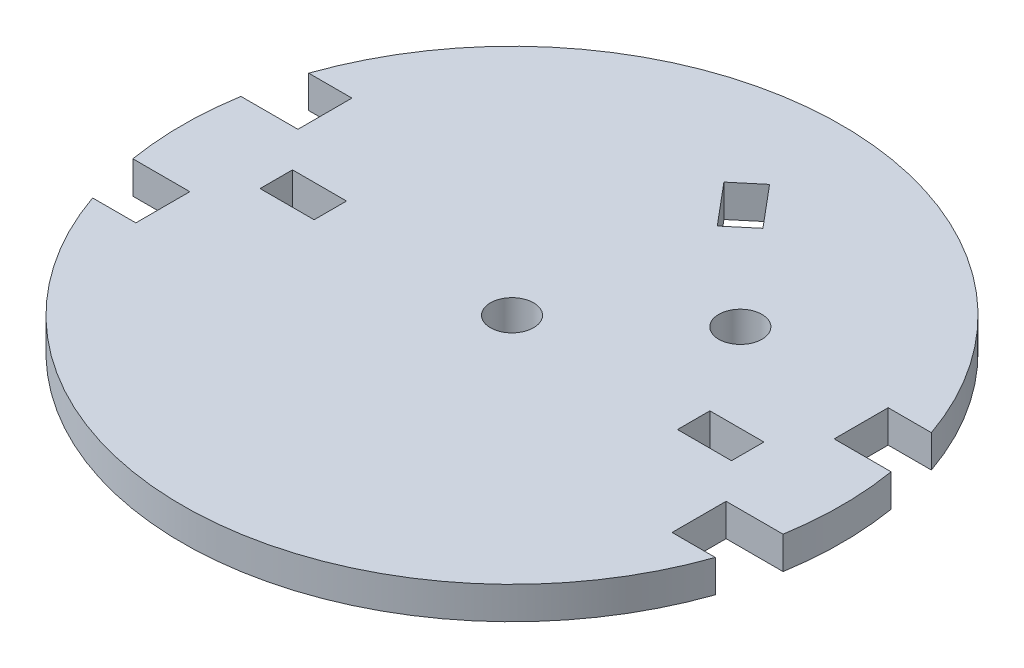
ISO-10303-21;
HEADER;
FILE_DESCRIPTION(('STEP AP214'),'2;1');
FILE_NAME('part.step','',(''),(''),'','','');
FILE_SCHEMA(('AUTOMOTIVE_DESIGN { 1 0 10303 214 1 1 1 1 }'));
ENDSEC;
DATA;
#1=APPLICATION_CONTEXT('core data for automotive mechanical design processes');
#2=APPLICATION_PROTOCOL_DEFINITION('international standard','automotive_design',2000,#1);
#3=PRODUCT_CONTEXT('',#1,'mechanical');
#4=PRODUCT('Part','Part','',(#3));
#5=PRODUCT_RELATED_PRODUCT_CATEGORY('part','',(#4));
#6=PRODUCT_DEFINITION_FORMATION('','',#4);
#7=PRODUCT_DEFINITION_CONTEXT('part definition',#1,'design');
#8=PRODUCT_DEFINITION('design','',#6,#7);
#9=PRODUCT_DEFINITION_SHAPE('','',#8);
#10=(LENGTH_UNIT() NAMED_UNIT(*) SI_UNIT(.MILLI.,.METRE.));
#11=(NAMED_UNIT(*) PLANE_ANGLE_UNIT() SI_UNIT($,.RADIAN.));
#12=(NAMED_UNIT(*) SI_UNIT($,.STERADIAN.) SOLID_ANGLE_UNIT());
#13=UNCERTAINTY_MEASURE_WITH_UNIT(LENGTH_MEASURE(1.E-05),#10,'distance_accuracy_value','');
#14=(GEOMETRIC_REPRESENTATION_CONTEXT(3) GLOBAL_UNCERTAINTY_ASSIGNED_CONTEXT((#13)) GLOBAL_UNIT_ASSIGNED_CONTEXT((#10,
#11,#12)) REPRESENTATION_CONTEXT('',''));
#15=CARTESIAN_POINT('',(0.,0.,0.));
#16=DIRECTION('',(0.,0.,1.));
#17=DIRECTION('',(1.,0.,0.));
#18=AXIS2_PLACEMENT_3D('',#15,#16,#17);
#19=CARTESIAN_POINT('',(0.,3.,0.));
#20=DIRECTION('',(0.,1.,0.));
#21=DIRECTION('',(0.,0.,1.));
#22=AXIS2_PLACEMENT_3D('',#19,#20,#21);
#23=PLANE('',#22);
#24=DIRECTION('',(0.,0.,1.));
#25=VECTOR('',#24,1.);
#26=CARTESIAN_POINT('',(24.8140590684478,3.,0.));
#27=LINE('',#26,#25);
#28=CARTESIAN_POINT('',(24.8140590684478,3.,5.));
#29=VERTEX_POINT('',#28);
#30=CARTESIAN_POINT('',(24.8140590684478,3.,10.));
#31=VERTEX_POINT('',#30);
#32=EDGE_CURVE('E283',#29,#31,#27,.T.);
#33=ORIENTED_EDGE('',*,*,#32,.F.);
#34=DIRECTION('',(1.,0.,0.));
#35=VECTOR('',#34,1.);
#36=CARTESIAN_POINT('',(0.,3.,5.));
#37=LINE('',#36,#35);
#38=CARTESIAN_POINT('',(30.0873727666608,3.,5.));
#39=VERTEX_POINT('',#38);
#40=EDGE_CURVE('E294',#29,#39,#37,.T.);
#41=ORIENTED_EDGE('',*,*,#40,.T.);
#42=CARTESIAN_POINT('',(0.,3.,0.));
#43=DIRECTION('',(0.,1.,0.));
#44=DIRECTION('',(0.,0.,1.));
#45=AXIS2_PLACEMENT_3D('',#42,#43,#44);
#46=CIRCLE('',#45,30.5);
#47=CARTESIAN_POINT('',(30.0873727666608,3.,-5.));
#48=VERTEX_POINT('',#47);
#49=EDGE_CURVE('E368',#39,#48,#46,.T.);
#50=ORIENTED_EDGE('',*,*,#49,.T.);
#51=DIRECTION('',(1.,0.,0.));
#52=VECTOR('',#51,1.);
#53=CARTESIAN_POINT('',(0.,3.,-5.00000000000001));
#54=LINE('',#53,#52);
#55=CARTESIAN_POINT('',(24.8140590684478,3.,-5.));
#56=VERTEX_POINT('',#55);
#57=EDGE_CURVE('E312',#56,#48,#54,.T.);
#58=ORIENTED_EDGE('',*,*,#57,.F.);
#59=DIRECTION('',(0.,0.,-1.));
#60=VECTOR('',#59,1.);
#61=CARTESIAN_POINT('',(24.8140590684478,3.,0.));
#62=LINE('',#61,#60);
#63=CARTESIAN_POINT('',(24.8140590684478,3.,-10.));
#64=VERTEX_POINT('',#63);
#65=EDGE_CURVE('E309',#56,#64,#62,.T.);
#66=ORIENTED_EDGE('',*,*,#65,.T.);
#67=DIRECTION('',(1.,0.,0.));
#68=VECTOR('',#67,1.);
#69=CARTESIAN_POINT('',(0.,3.,-10.));
#70=LINE('',#69,#68);
#71=CARTESIAN_POINT('',(28.8140590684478,3.,-10.));
#72=VERTEX_POINT('',#71);
#73=EDGE_CURVE('E306',#64,#72,#70,.T.);
#74=ORIENTED_EDGE('',*,*,#73,.T.);
#75=CARTESIAN_POINT('',(-28.8140590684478,3.,-10.));
#76=VERTEX_POINT('',#75);
#77=EDGE_CURVE('E815',#72,#76,#46,.T.);
#78=ORIENTED_EDGE('',*,*,#77,.T.);
#79=DIRECTION('',(-1.,0.,0.));
#80=VECTOR('',#79,1.);
#81=CARTESIAN_POINT('',(0.,3.,-10.));
#82=LINE('',#81,#80);
#83=CARTESIAN_POINT('',(-24.8140590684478,3.,-10.));
#84=VERTEX_POINT('',#83);
#85=EDGE_CURVE('E330',#84,#76,#82,.T.);
#86=ORIENTED_EDGE('',*,*,#85,.F.);
#87=DIRECTION('',(0.,0.,-1.));
#88=VECTOR('',#87,1.);
#89=CARTESIAN_POINT('',(-24.8140590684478,3.,0.));
#90=LINE('',#89,#88);
#91=CARTESIAN_POINT('',(-24.8140590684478,3.,-5.));
#92=VERTEX_POINT('',#91);
#93=EDGE_CURVE('E327',#92,#84,#90,.T.);
#94=ORIENTED_EDGE('',*,*,#93,.F.);
#95=DIRECTION('',(-1.,0.,0.));
#96=VECTOR('',#95,1.);
#97=CARTESIAN_POINT('',(0.,3.,-5.));
#98=LINE('',#97,#96);
#99=CARTESIAN_POINT('',(-30.0873727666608,3.,-5.));
#100=VERTEX_POINT('',#99);
#101=EDGE_CURVE('E324',#92,#100,#98,.T.);
#102=ORIENTED_EDGE('',*,*,#101,.T.);
#103=CARTESIAN_POINT('',(-30.0873727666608,3.,5.));
#104=VERTEX_POINT('',#103);
#105=EDGE_CURVE('E369',#100,#104,#46,.T.);
#106=ORIENTED_EDGE('',*,*,#105,.T.);
#107=DIRECTION('',(-1.,0.,0.));
#108=VECTOR('',#107,1.);
#109=CARTESIAN_POINT('',(0.,3.,5.00000000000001));
#110=LINE('',#109,#108);
#111=CARTESIAN_POINT('',(-24.8140590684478,3.,5.));
#112=VERTEX_POINT('',#111);
#113=EDGE_CURVE('E336',#112,#104,#110,.T.);
#114=ORIENTED_EDGE('',*,*,#113,.F.);
#115=DIRECTION('',(0.,0.,1.));
#116=VECTOR('',#115,1.);
#117=CARTESIAN_POINT('',(-24.8140590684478,3.,0.));
#118=LINE('',#117,#116);
#119=CARTESIAN_POINT('',(-24.8140590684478,3.,10.));
#120=VERTEX_POINT('',#119);
#121=EDGE_CURVE('E348',#112,#120,#118,.T.);
#122=ORIENTED_EDGE('',*,*,#121,.T.);
#123=DIRECTION('',(-1.,0.,0.));
#124=VECTOR('',#123,1.);
#125=CARTESIAN_POINT('',(0.,3.,10.));
#126=LINE('',#125,#124);
#127=CARTESIAN_POINT('',(-28.8140590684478,3.,10.));
#128=VERTEX_POINT('',#127);
#129=EDGE_CURVE('E345',#120,#128,#126,.T.);
#130=ORIENTED_EDGE('',*,*,#129,.T.);
#131=CARTESIAN_POINT('',(28.8140590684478,3.,10.));
#132=VERTEX_POINT('',#131);
#133=EDGE_CURVE('E364',#128,#132,#46,.T.);
#134=ORIENTED_EDGE('',*,*,#133,.T.);
#135=DIRECTION('',(1.,0.,0.));
#136=VECTOR('',#135,1.);
#137=CARTESIAN_POINT('',(0.,3.,10.));
#138=LINE('',#137,#136);
#139=EDGE_CURVE('E292',#31,#132,#138,.T.);
#140=ORIENTED_EDGE('',*,*,#139,.F.);
#141=EDGE_LOOP('',(#33,#41,#50,#58,#66,#74,#78,#86,#94,#102,#106,#114,#122,#130,#134,#140));
#142=FACE_BOUND('',#141,.T.);
#143=CARTESIAN_POINT('',(0.,3.,0.));
#144=DIRECTION('',(0.,1.,0.));
#145=DIRECTION('',(0.,0.,1.));
#146=AXIS2_PLACEMENT_3D('',#143,#144,#145);
#147=CIRCLE('',#146,2.);
#148=CARTESIAN_POINT('',(0.,3.,2.));
#149=VERTEX_POINT('',#148);
#150=EDGE_CURVE('E354',#149,#149,#147,.T.);
#151=ORIENTED_EDGE('',*,*,#150,.F.);
#152=EDGE_LOOP('',(#151));
#153=FACE_BOUND('',#152,.T.);
#154=DIRECTION('',(1.,0.,0.));
#155=VECTOR('',#154,1.);
#156=CARTESIAN_POINT('',(-16.8140590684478,3.,1.5));
#157=LINE('',#156,#155);
#158=CARTESIAN_POINT('',(-21.8140590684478,3.,1.5));
#159=VERTEX_POINT('',#158);
#160=CARTESIAN_POINT('',(-16.8140590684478,3.,1.5));
#161=VERTEX_POINT('',#160);
#162=EDGE_CURVE('E263',#159,#161,#157,.T.);
#163=ORIENTED_EDGE('',*,*,#162,.F.);
#164=DIRECTION('',(0.,0.,1.));
#165=VECTOR('',#164,1.);
#166=CARTESIAN_POINT('',(-21.8140590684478,3.,-1.5));
#167=LINE('',#166,#165);
#168=CARTESIAN_POINT('',(-21.8140590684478,3.,-1.5));
#169=VERTEX_POINT('',#168);
#170=EDGE_CURVE('E277',#169,#159,#167,.T.);
#171=ORIENTED_EDGE('',*,*,#170,.F.);
#172=DIRECTION('',(-1.,0.,0.));
#173=VECTOR('',#172,1.);
#174=CARTESIAN_POINT('',(-16.8140590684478,3.,-1.5));
#175=LINE('',#174,#173);
#176=CARTESIAN_POINT('',(-16.8140590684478,3.,-1.5));
#177=VERTEX_POINT('',#176);
#178=EDGE_CURVE('E274',#177,#169,#175,.T.);
#179=ORIENTED_EDGE('',*,*,#178,.F.);
#180=DIRECTION('',(0.,0.,-1.));
#181=VECTOR('',#180,1.);
#182=CARTESIAN_POINT('',(-16.8140590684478,3.,1.5));
#183=LINE('',#182,#181);
#184=EDGE_CURVE('E271',#161,#177,#183,.T.);
#185=ORIENTED_EDGE('',*,*,#184,.F.);
#186=EDGE_LOOP('',(#163,#171,#179,#185));
#187=FACE_BOUND('',#186,.T.);
#188=DIRECTION('',(0.,0.,1.));
#189=VECTOR('',#188,1.);
#190=CARTESIAN_POINT('',(16.8140590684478,3.,1.5));
#191=LINE('',#190,#189);
#192=CARTESIAN_POINT('',(16.8140590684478,3.,-1.5));
#193=VERTEX_POINT('',#192);
#194=CARTESIAN_POINT('',(16.8140590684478,3.,1.5));
#195=VERTEX_POINT('',#194);
#196=EDGE_CURVE('E249',#193,#195,#191,.T.);
#197=ORIENTED_EDGE('',*,*,#196,.F.);
#198=DIRECTION('',(-1.,0.,0.));
#199=VECTOR('',#198,1.);
#200=CARTESIAN_POINT('',(16.8140590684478,3.,-1.5));
#201=LINE('',#200,#199);
#202=CARTESIAN_POINT('',(21.8140590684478,3.,-1.5));
#203=VERTEX_POINT('',#202);
#204=EDGE_CURVE('E257',#203,#193,#201,.T.);
#205=ORIENTED_EDGE('',*,*,#204,.F.);
#206=DIRECTION('',(0.,0.,-1.));
#207=VECTOR('',#206,1.);
#208=CARTESIAN_POINT('',(21.8140590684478,3.,-1.5));
#209=LINE('',#208,#207);
#210=CARTESIAN_POINT('',(21.8140590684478,3.,1.5));
#211=VERTEX_POINT('',#210);
#212=EDGE_CURVE('E254',#211,#203,#209,.T.);
#213=ORIENTED_EDGE('',*,*,#212,.F.);
#214=DIRECTION('',(1.,0.,0.));
#215=VECTOR('',#214,1.);
#216=CARTESIAN_POINT('',(16.8140590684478,3.,1.5));
#217=LINE('',#216,#215);
#218=EDGE_CURVE('E251',#195,#211,#217,.T.);
#219=ORIENTED_EDGE('',*,*,#218,.F.);
#220=EDGE_LOOP('',(#197,#205,#213,#219));
#221=FACE_BOUND('',#220,.T.);
#222=CARTESIAN_POINT('',(11.4906666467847,3.,-9.64181414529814));
#223=DIRECTION('',(0.,1.,0.));
#224=DIRECTION('',(0.,0.,1.));
#225=AXIS2_PLACEMENT_3D('',#222,#223,#224);
#226=CIRCLE('',#225,2.);
#227=CARTESIAN_POINT('',(11.4906666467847,3.,-7.64181414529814));
#228=VERTEX_POINT('',#227);
#229=EDGE_CURVE('E243',#228,#228,#226,.T.);
#230=ORIENTED_EDGE('',*,*,#229,.F.);
#231=EDGE_LOOP('',(#230));
#232=FACE_BOUND('',#231,.T.);
#233=DIRECTION('',(0.64278760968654,0.,0.766044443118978));
#234=VECTOR('',#233,1.);
#235=CARTESIAN_POINT('',(11.8736888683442,3.,-9.96320795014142));
#236=LINE('',#235,#234);
#237=CARTESIAN_POINT('',(1.42839021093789,3.,-22.4114301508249));
#238=VERTEX_POINT('',#237);
#239=CARTESIAN_POINT('',(4.64232825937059,3.,-18.58120793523));
#240=VERTEX_POINT('',#239);
#241=EDGE_CURVE('E231',#238,#240,#236,.T.);
#242=ORIENTED_EDGE('',*,*,#241,.T.);
#243=DIRECTION('',(-0.766044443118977,0.,0.64278760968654));
#244=VECTOR('',#243,1.);
#245=CARTESIAN_POINT('',(-7.23136060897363,3.,-8.61799998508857));
#246=LINE('',#245,#244);
#247=CARTESIAN_POINT('',(2.34419493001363,3.,-16.6528451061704));
#248=VERTEX_POINT('',#247);
#249=EDGE_CURVE('E50',#240,#248,#246,.T.);
#250=ORIENTED_EDGE('',*,*,#249,.T.);
#251=DIRECTION('',(0.642787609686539,0.,0.766044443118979));
#252=VECTOR('',#251,1.);
#253=CARTESIAN_POINT('',(9.57555553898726,3.,-8.03484512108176));
#254=LINE('',#253,#252);
#255=CARTESIAN_POINT('',(-0.86974311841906,3.,-20.4830673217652));
#256=VERTEX_POINT('',#255);
#257=EDGE_CURVE('E236',#256,#248,#254,.T.);
#258=ORIENTED_EDGE('',*,*,#257,.F.);
#259=DIRECTION('',(-0.766044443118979,0.,0.642787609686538));
#260=VECTOR('',#259,1.);
#261=CARTESIAN_POINT('',(-10.4452986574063,3.,-12.4482222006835));
#262=LINE('',#261,#260);
#263=EDGE_CURVE('E222',#238,#256,#262,.T.);
#264=ORIENTED_EDGE('',*,*,#263,.F.);
#265=EDGE_LOOP('',(#242,#250,#258,#264));
#266=FACE_BOUND('',#265,.T.);
#267=ADVANCED_FACE('F35',(#142,#153,#187,#221,#232,#266),#23,.T.);
#268=CARTESIAN_POINT('',(0.,0.,0.));
#269=DIRECTION('',(0.,1.,0.));
#270=DIRECTION('',(0.,0.,1.));
#271=AXIS2_PLACEMENT_3D('',#268,#269,#270);
#272=PLANE('',#271);
#273=DIRECTION('',(1.,0.,0.));
#274=VECTOR('',#273,1.);
#275=CARTESIAN_POINT('',(0.,0.,5.));
#276=LINE('',#275,#274);
#277=CARTESIAN_POINT('',(24.8140590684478,0.,5.));
#278=VERTEX_POINT('',#277);
#279=CARTESIAN_POINT('',(30.0873727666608,0.,5.));
#280=VERTEX_POINT('',#279);
#281=EDGE_CURVE('E304',#278,#280,#276,.T.);
#282=ORIENTED_EDGE('',*,*,#281,.F.);
#283=DIRECTION('',(0.,0.,1.));
#284=VECTOR('',#283,1.);
#285=CARTESIAN_POINT('',(24.8140590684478,0.,0.));
#286=LINE('',#285,#284);
#287=CARTESIAN_POINT('',(24.8140590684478,0.,10.));
#288=VERTEX_POINT('',#287);
#289=EDGE_CURVE('E404',#278,#288,#286,.T.);
#290=ORIENTED_EDGE('',*,*,#289,.T.);
#291=DIRECTION('',(1.,0.,0.));
#292=VECTOR('',#291,1.);
#293=CARTESIAN_POINT('',(0.,0.,10.));
#294=LINE('',#293,#292);
#295=CARTESIAN_POINT('',(28.8140590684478,0.,10.));
#296=VERTEX_POINT('',#295);
#297=EDGE_CURVE('E300',#288,#296,#294,.T.);
#298=ORIENTED_EDGE('',*,*,#297,.T.);
#299=CARTESIAN_POINT('',(0.,0.,0.));
#300=DIRECTION('',(0.,1.,0.));
#301=DIRECTION('',(0.,0.,1.));
#302=AXIS2_PLACEMENT_3D('',#299,#300,#301);
#303=CIRCLE('',#302,30.5);
#304=CARTESIAN_POINT('',(-28.8140590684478,0.,10.));
#305=VERTEX_POINT('',#304);
#306=EDGE_CURVE('E370',#305,#296,#303,.T.);
#307=ORIENTED_EDGE('',*,*,#306,.F.);
#308=DIRECTION('',(-1.,0.,0.));
#309=VECTOR('',#308,1.);
#310=CARTESIAN_POINT('',(0.,0.,10.));
#311=LINE('',#310,#309);
#312=CARTESIAN_POINT('',(-24.8140590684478,0.,10.));
#313=VERTEX_POINT('',#312);
#314=EDGE_CURVE('E367',#313,#305,#311,.T.);
#315=ORIENTED_EDGE('',*,*,#314,.F.);
#316=DIRECTION('',(0.,0.,1.));
#317=VECTOR('',#316,1.);
#318=CARTESIAN_POINT('',(-24.8140590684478,0.,0.));
#319=LINE('',#318,#317);
#320=CARTESIAN_POINT('',(-24.8140590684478,0.,5.));
#321=VERTEX_POINT('',#320);
#322=EDGE_CURVE('E378',#321,#313,#319,.T.);
#323=ORIENTED_EDGE('',*,*,#322,.F.);
#324=DIRECTION('',(-1.,0.,0.));
#325=VECTOR('',#324,1.);
#326=CARTESIAN_POINT('',(0.,0.,5.00000000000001));
#327=LINE('',#326,#325);
#328=CARTESIAN_POINT('',(-30.0873727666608,0.,5.));
#329=VERTEX_POINT('',#328);
#330=EDGE_CURVE('E381',#321,#329,#327,.T.);
#331=ORIENTED_EDGE('',*,*,#330,.T.);
#332=CARTESIAN_POINT('',(-30.0873727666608,0.,-5.));
#333=VERTEX_POINT('',#332);
#334=EDGE_CURVE('E374',#333,#329,#303,.T.);
#335=ORIENTED_EDGE('',*,*,#334,.F.);
#336=DIRECTION('',(-1.,0.,0.));
#337=VECTOR('',#336,1.);
#338=CARTESIAN_POINT('',(0.,0.,-5.));
#339=LINE('',#338,#337);
#340=CARTESIAN_POINT('',(-24.8140590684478,0.,-5.));
#341=VERTEX_POINT('',#340);
#342=EDGE_CURVE('E390',#341,#333,#339,.T.);
#343=ORIENTED_EDGE('',*,*,#342,.F.);
#344=DIRECTION('',(0.,0.,-1.));
#345=VECTOR('',#344,1.);
#346=CARTESIAN_POINT('',(-24.8140590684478,0.,0.));
#347=LINE('',#346,#345);
#348=CARTESIAN_POINT('',(-24.8140590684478,0.,-10.));
#349=VERTEX_POINT('',#348);
#350=EDGE_CURVE('E384',#341,#349,#347,.T.);
#351=ORIENTED_EDGE('',*,*,#350,.T.);
#352=DIRECTION('',(-1.,0.,0.));
#353=VECTOR('',#352,1.);
#354=CARTESIAN_POINT('',(0.,0.,-10.));
#355=LINE('',#354,#353);
#356=CARTESIAN_POINT('',(-28.8140590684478,0.,-10.));
#357=VERTEX_POINT('',#356);
#358=EDGE_CURVE('E387',#349,#357,#355,.T.);
#359=ORIENTED_EDGE('',*,*,#358,.T.);
#360=CARTESIAN_POINT('',(28.8140590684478,0.,-10.));
#361=VERTEX_POINT('',#360);
#362=EDGE_CURVE('E799',#361,#357,#303,.T.);
#363=ORIENTED_EDGE('',*,*,#362,.F.);
#364=DIRECTION('',(1.,0.,0.));
#365=VECTOR('',#364,1.);
#366=CARTESIAN_POINT('',(0.,0.,-10.));
#367=LINE('',#366,#365);
#368=CARTESIAN_POINT('',(24.8140590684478,0.,-10.));
#369=VERTEX_POINT('',#368);
#370=EDGE_CURVE('E322',#369,#361,#367,.T.);
#371=ORIENTED_EDGE('',*,*,#370,.F.);
#372=DIRECTION('',(0.,0.,-1.));
#373=VECTOR('',#372,1.);
#374=CARTESIAN_POINT('',(24.8140590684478,0.,0.));
#375=LINE('',#374,#373);
#376=CARTESIAN_POINT('',(24.8140590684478,0.,-5.));
#377=VERTEX_POINT('',#376);
#378=EDGE_CURVE('E397',#377,#369,#375,.T.);
#379=ORIENTED_EDGE('',*,*,#378,.F.);
#380=DIRECTION('',(1.,0.,0.));
#381=VECTOR('',#380,1.);
#382=CARTESIAN_POINT('',(0.,0.,-5.00000000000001));
#383=LINE('',#382,#381);
#384=CARTESIAN_POINT('',(30.0873727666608,0.,-5.));
#385=VERTEX_POINT('',#384);
#386=EDGE_CURVE('E318',#377,#385,#383,.T.);
#387=ORIENTED_EDGE('',*,*,#386,.T.);
#388=EDGE_CURVE('E373',#280,#385,#303,.T.);
#389=ORIENTED_EDGE('',*,*,#388,.F.);
#390=EDGE_LOOP('',(#282,#290,#298,#307,#315,#323,#331,#335,#343,#351,#359,#363,#371,#379,#387,#389));
#391=FACE_BOUND('',#390,.T.);
#392=CARTESIAN_POINT('',(0.,0.,0.));
#393=DIRECTION('',(0.,1.,0.));
#394=DIRECTION('',(0.,0.,1.));
#395=AXIS2_PLACEMENT_3D('',#392,#393,#394);
#396=CIRCLE('',#395,2.);
#397=CARTESIAN_POINT('',(0.,0.,2.));
#398=VERTEX_POINT('',#397);
#399=EDGE_CURVE('E363',#398,#398,#396,.T.);
#400=ORIENTED_EDGE('',*,*,#399,.T.);
#401=EDGE_LOOP('',(#400));
#402=FACE_BOUND('',#401,.T.);
#403=DIRECTION('',(0.,0.,1.));
#404=VECTOR('',#403,1.);
#405=CARTESIAN_POINT('',(-21.8140590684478,0.,0.));
#406=LINE('',#405,#404);
#407=CARTESIAN_POINT('',(-21.8140590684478,0.,-1.5));
#408=VERTEX_POINT('',#407);
#409=CARTESIAN_POINT('',(-21.8140590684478,0.,1.5));
#410=VERTEX_POINT('',#409);
#411=EDGE_CURVE('E413',#408,#410,#406,.T.);
#412=ORIENTED_EDGE('',*,*,#411,.T.);
#413=DIRECTION('',(1.,0.,0.));
#414=VECTOR('',#413,1.);
#415=CARTESIAN_POINT('',(0.,0.,1.5));
#416=LINE('',#415,#414);
#417=CARTESIAN_POINT('',(-16.8140590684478,0.,1.5));
#418=VERTEX_POINT('',#417);
#419=EDGE_CURVE('E416',#410,#418,#416,.T.);
#420=ORIENTED_EDGE('',*,*,#419,.T.);
#421=DIRECTION('',(0.,0.,-1.));
#422=VECTOR('',#421,1.);
#423=CARTESIAN_POINT('',(-16.8140590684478,0.,0.));
#424=LINE('',#423,#422);
#425=CARTESIAN_POINT('',(-16.8140590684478,0.,-1.5));
#426=VERTEX_POINT('',#425);
#427=EDGE_CURVE('E407',#418,#426,#424,.T.);
#428=ORIENTED_EDGE('',*,*,#427,.T.);
#429=DIRECTION('',(-1.,0.,0.));
#430=VECTOR('',#429,1.);
#431=CARTESIAN_POINT('',(0.,0.,-1.5));
#432=LINE('',#431,#430);
#433=EDGE_CURVE('E410',#426,#408,#432,.T.);
#434=ORIENTED_EDGE('',*,*,#433,.T.);
#435=EDGE_LOOP('',(#412,#420,#428,#434));
#436=FACE_BOUND('',#435,.T.);
#437=DIRECTION('',(-1.,0.,0.));
#438=VECTOR('',#437,1.);
#439=CARTESIAN_POINT('',(0.,0.,-1.5));
#440=LINE('',#439,#438);
#441=CARTESIAN_POINT('',(21.8140590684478,0.,-1.5));
#442=VERTEX_POINT('',#441);
#443=CARTESIAN_POINT('',(16.8140590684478,0.,-1.5));
#444=VERTEX_POINT('',#443);
#445=EDGE_CURVE('E425',#442,#444,#440,.T.);
#446=ORIENTED_EDGE('',*,*,#445,.T.);
#447=DIRECTION('',(0.,0.,1.));
#448=VECTOR('',#447,1.);
#449=CARTESIAN_POINT('',(16.8140590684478,0.,0.));
#450=LINE('',#449,#448);
#451=CARTESIAN_POINT('',(16.8140590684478,0.,1.5));
#452=VERTEX_POINT('',#451);
#453=EDGE_CURVE('E428',#444,#452,#450,.T.);
#454=ORIENTED_EDGE('',*,*,#453,.T.);
#455=DIRECTION('',(1.,0.,0.));
#456=VECTOR('',#455,1.);
#457=CARTESIAN_POINT('',(0.,0.,1.5));
#458=LINE('',#457,#456);
#459=CARTESIAN_POINT('',(21.8140590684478,0.,1.5));
#460=VERTEX_POINT('',#459);
#461=EDGE_CURVE('E419',#452,#460,#458,.T.);
#462=ORIENTED_EDGE('',*,*,#461,.T.);
#463=DIRECTION('',(0.,0.,-1.));
#464=VECTOR('',#463,1.);
#465=CARTESIAN_POINT('',(21.8140590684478,0.,0.));
#466=LINE('',#465,#464);
#467=EDGE_CURVE('E422',#460,#442,#466,.T.);
#468=ORIENTED_EDGE('',*,*,#467,.T.);
#469=EDGE_LOOP('',(#446,#454,#462,#468));
#470=FACE_BOUND('',#469,.T.);
#471=CARTESIAN_POINT('',(11.4906666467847,0.,-9.64181414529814));
#472=DIRECTION('',(0.,1.,0.));
#473=DIRECTION('',(0.,0.,1.));
#474=AXIS2_PLACEMENT_3D('',#471,#472,#473);
#475=CIRCLE('',#474,2.);
#476=CARTESIAN_POINT('',(11.4906666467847,0.,-7.64181414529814));
#477=VERTEX_POINT('',#476);
#478=EDGE_CURVE('E248',#477,#477,#475,.T.);
#479=ORIENTED_EDGE('',*,*,#478,.T.);
#480=EDGE_LOOP('',(#479));
#481=FACE_BOUND('',#480,.T.);
#482=DIRECTION('',(-0.766044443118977,0.,0.64278760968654));
#483=VECTOR('',#482,1.);
#484=CARTESIAN_POINT('',(-7.23136060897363,0.,-8.61799998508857));
#485=LINE('',#484,#483);
#486=CARTESIAN_POINT('',(4.64232825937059,0.,-18.58120793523));
#487=VERTEX_POINT('',#486);
#488=CARTESIAN_POINT('',(2.34419493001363,0.,-16.6528451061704));
#489=VERTEX_POINT('',#488);
#490=EDGE_CURVE('E11',#487,#489,#485,.T.);
#491=ORIENTED_EDGE('',*,*,#490,.F.);
#492=DIRECTION('',(0.64278760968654,0.,0.766044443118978));
#493=VECTOR('',#492,1.);
#494=CARTESIAN_POINT('',(11.8736888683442,0.,-9.96320795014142));
#495=LINE('',#494,#493);
#496=CARTESIAN_POINT('',(1.4283902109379,0.,-22.4114301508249));
#497=VERTEX_POINT('',#496);
#498=EDGE_CURVE('E431',#497,#487,#495,.T.);
#499=ORIENTED_EDGE('',*,*,#498,.F.);
#500=DIRECTION('',(-0.766044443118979,0.,0.642787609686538));
#501=VECTOR('',#500,1.);
#502=CARTESIAN_POINT('',(-10.4452986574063,0.,-12.4482222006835));
#503=LINE('',#502,#501);
#504=CARTESIAN_POINT('',(-0.86974311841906,0.,-20.4830673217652));
#505=VERTEX_POINT('',#504);
#506=EDGE_CURVE('E225',#497,#505,#503,.T.);
#507=ORIENTED_EDGE('',*,*,#506,.T.);
#508=DIRECTION('',(0.642787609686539,0.,0.766044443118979));
#509=VECTOR('',#508,1.);
#510=CARTESIAN_POINT('',(9.57555553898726,0.,-8.03484512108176));
#511=LINE('',#510,#509);
#512=EDGE_CURVE('E43',#505,#489,#511,.T.);
#513=ORIENTED_EDGE('',*,*,#512,.T.);
#514=EDGE_LOOP('',(#491,#499,#507,#513));
#515=FACE_BOUND('',#514,.T.);
#516=ADVANCED_FACE('F438',(#391,#402,#436,#470,#481,#515),#272,.F.);
#517=CARTESIAN_POINT('',(0.,3.,0.));
#518=DIRECTION('',(0.,-1.,0.));
#519=DIRECTION('',(0.,0.,-1.));
#520=AXIS2_PLACEMENT_3D('',#517,#518,#519);
#521=CYLINDRICAL_SURFACE('',#520,30.5);
#522=DIRECTION('',(0.,-1.,0.));
#523=VECTOR('',#522,1.);
#524=CARTESIAN_POINT('',(30.0873727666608,3.,5.));
#525=LINE('',#524,#523);
#526=EDGE_CURVE('E402',#280,#39,#525,.F.);
#527=ORIENTED_EDGE('',*,*,#526,.F.);
#528=ORIENTED_EDGE('',*,*,#388,.T.);
#529=DIRECTION('',(0.,-1.,0.));
#530=VECTOR('',#529,1.);
#531=CARTESIAN_POINT('',(30.0873727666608,3.,-5.));
#532=LINE('',#531,#530);
#533=EDGE_CURVE('E392',#385,#48,#532,.F.);
#534=ORIENTED_EDGE('',*,*,#533,.T.);
#535=ORIENTED_EDGE('',*,*,#49,.F.);
#536=EDGE_LOOP('',(#527,#528,#534,#535));
#537=FACE_BOUND('',#536,.T.);
#538=ADVANCED_FACE('F461',(#537),#521,.T.);
#539=DIRECTION('',(0.,-1.,0.));
#540=VECTOR('',#539,1.);
#541=CARTESIAN_POINT('',(28.8140590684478,3.,-10.));
#542=LINE('',#541,#540);
#543=EDGE_CURVE('E395',#361,#72,#542,.F.);
#544=ORIENTED_EDGE('',*,*,#543,.F.);
#545=ORIENTED_EDGE('',*,*,#362,.T.);
#546=DIRECTION('',(0.,1.,0.));
#547=VECTOR('',#546,1.);
#548=CARTESIAN_POINT('',(-28.8140590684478,-1.,-10.));
#549=LINE('',#548,#547);
#550=EDGE_CURVE('E337',#357,#76,#549,.T.);
#551=ORIENTED_EDGE('',*,*,#550,.T.);
#552=ORIENTED_EDGE('',*,*,#77,.F.);
#553=EDGE_LOOP('',(#544,#545,#551,#552));
#554=FACE_BOUND('',#553,.T.);
#555=ADVANCED_FACE('F625',(#554),#521,.T.);
#556=DIRECTION('',(0.,1.,0.));
#557=VECTOR('',#556,1.);
#558=CARTESIAN_POINT('',(-30.0873727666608,-1.,-5.));
#559=LINE('',#558,#557);
#560=EDGE_CURVE('E334',#333,#100,#559,.T.);
#561=ORIENTED_EDGE('',*,*,#560,.F.);
#562=ORIENTED_EDGE('',*,*,#334,.T.);
#563=DIRECTION('',(0.,1.,0.));
#564=VECTOR('',#563,1.);
#565=CARTESIAN_POINT('',(-30.0873727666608,-1.,5.));
#566=LINE('',#565,#564);
#567=EDGE_CURVE('E351',#329,#104,#566,.T.);
#568=ORIENTED_EDGE('',*,*,#567,.T.);
#569=ORIENTED_EDGE('',*,*,#105,.F.);
#570=EDGE_LOOP('',(#561,#562,#568,#569));
#571=FACE_BOUND('',#570,.T.);
#572=ADVANCED_FACE('F633',(#571),#521,.T.);
#573=ORIENTED_EDGE('',*,*,#306,.T.);
#574=DIRECTION('',(0.,-1.,0.));
#575=VECTOR('',#574,1.);
#576=CARTESIAN_POINT('',(28.8140590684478,3.,10.));
#577=LINE('',#576,#575);
#578=EDGE_CURVE('E399',#296,#132,#577,.F.);
#579=ORIENTED_EDGE('',*,*,#578,.T.);
#580=ORIENTED_EDGE('',*,*,#133,.F.);
#581=DIRECTION('',(0.,1.,0.));
#582=VECTOR('',#581,1.);
#583=CARTESIAN_POINT('',(-28.8140590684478,-1.,10.));
#584=LINE('',#583,#582);
#585=EDGE_CURVE('E357',#305,#128,#584,.T.);
#586=ORIENTED_EDGE('',*,*,#585,.F.);
#587=EDGE_LOOP('',(#573,#579,#580,#586));
#588=FACE_BOUND('',#587,.T.);
#589=ADVANCED_FACE('F37',(#588),#521,.T.);
#590=CARTESIAN_POINT('',(0.,-1.,0.));
#591=DIRECTION('',(0.,1.,0.));
#592=DIRECTION('',(0.,0.,1.));
#593=AXIS2_PLACEMENT_3D('',#590,#591,#592);
#594=CYLINDRICAL_SURFACE('',#593,2.);
#595=ORIENTED_EDGE('',*,*,#150,.T.);
#596=EDGE_LOOP('',(#595));
#597=FACE_BOUND('',#596,.T.);
#598=ORIENTED_EDGE('',*,*,#399,.F.);
#599=EDGE_LOOP('',(#598));
#600=FACE_BOUND('',#599,.T.);
#601=ADVANCED_FACE('F466',(#597,#600),#594,.F.);
#602=CARTESIAN_POINT('',(0.,-1.,5.00000000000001));
#603=DIRECTION('',(0.,0.,-1.));
#604=DIRECTION('',(-1.,0.,0.));
#605=AXIS2_PLACEMENT_3D('',#602,#603,#604);
#606=PLANE('',#605);
#607=DIRECTION('',(0.,1.,0.));
#608=VECTOR('',#607,1.);
#609=CARTESIAN_POINT('',(-24.8140590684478,-1.,5.));
#610=LINE('',#609,#608);
#611=EDGE_CURVE('E352',#321,#112,#610,.T.);
#612=ORIENTED_EDGE('',*,*,#611,.T.);
#613=ORIENTED_EDGE('',*,*,#113,.T.);
#614=ORIENTED_EDGE('',*,*,#567,.F.);
#615=ORIENTED_EDGE('',*,*,#330,.F.);
#616=EDGE_LOOP('',(#612,#613,#614,#615));
#617=FACE_BOUND('',#616,.T.);
#618=ADVANCED_FACE('F469',(#617),#606,.F.);
#619=CARTESIAN_POINT('',(-24.8140590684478,-1.,0.));
#620=DIRECTION('',(-1.,0.,0.));
#621=DIRECTION('',(0.,0.,1.));
#622=AXIS2_PLACEMENT_3D('',#619,#620,#621);
#623=PLANE('',#622);
#624=ORIENTED_EDGE('',*,*,#322,.T.);
#625=DIRECTION('',(0.,1.,0.));
#626=VECTOR('',#625,1.);
#627=CARTESIAN_POINT('',(-24.8140590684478,-1.,10.));
#628=LINE('',#627,#626);
#629=EDGE_CURVE('E355',#313,#120,#628,.T.);
#630=ORIENTED_EDGE('',*,*,#629,.T.);
#631=ORIENTED_EDGE('',*,*,#121,.F.);
#632=ORIENTED_EDGE('',*,*,#611,.F.);
#633=EDGE_LOOP('',(#624,#630,#631,#632));
#634=FACE_BOUND('',#633,.T.);
#635=ADVANCED_FACE('F473',(#634),#623,.T.);
#636=CARTESIAN_POINT('',(0.,-1.,10.));
#637=DIRECTION('',(0.,0.,-1.));
#638=DIRECTION('',(-1.,0.,0.));
#639=AXIS2_PLACEMENT_3D('',#636,#637,#638);
#640=PLANE('',#639);
#641=ORIENTED_EDGE('',*,*,#314,.T.);
#642=ORIENTED_EDGE('',*,*,#585,.T.);
#643=ORIENTED_EDGE('',*,*,#129,.F.);
#644=ORIENTED_EDGE('',*,*,#629,.F.);
#645=EDGE_LOOP('',(#641,#642,#643,#644));
#646=FACE_BOUND('',#645,.T.);
#647=ADVANCED_FACE('F475',(#646),#640,.T.);
#648=CARTESIAN_POINT('',(0.,-1.,-5.));
#649=DIRECTION('',(0.,0.,-1.));
#650=DIRECTION('',(-1.,0.,0.));
#651=AXIS2_PLACEMENT_3D('',#648,#649,#650);
#652=PLANE('',#651);
#653=ORIENTED_EDGE('',*,*,#342,.T.);
#654=ORIENTED_EDGE('',*,*,#560,.T.);
#655=ORIENTED_EDGE('',*,*,#101,.F.);
#656=DIRECTION('',(0.,1.,0.));
#657=VECTOR('',#656,1.);
#658=CARTESIAN_POINT('',(-24.8140590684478,-1.,-5.));
#659=LINE('',#658,#657);
#660=EDGE_CURVE('E333',#341,#92,#659,.T.);
#661=ORIENTED_EDGE('',*,*,#660,.F.);
#662=EDGE_LOOP('',(#653,#654,#655,#661));
#663=FACE_BOUND('',#662,.T.);
#664=ADVANCED_FACE('F478',(#663),#652,.T.);
#665=CARTESIAN_POINT('',(0.,-1.,-10.));
#666=DIRECTION('',(0.,0.,-1.));
#667=DIRECTION('',(-1.,0.,0.));
#668=AXIS2_PLACEMENT_3D('',#665,#666,#667);
#669=PLANE('',#668);
#670=DIRECTION('',(0.,1.,0.));
#671=VECTOR('',#670,1.);
#672=CARTESIAN_POINT('',(-24.8140590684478,-1.,-10.));
#673=LINE('',#672,#671);
#674=EDGE_CURVE('E340',#349,#84,#673,.T.);
#675=ORIENTED_EDGE('',*,*,#674,.T.);
#676=ORIENTED_EDGE('',*,*,#85,.T.);
#677=ORIENTED_EDGE('',*,*,#550,.F.);
#678=ORIENTED_EDGE('',*,*,#358,.F.);
#679=EDGE_LOOP('',(#675,#676,#677,#678));
#680=FACE_BOUND('',#679,.T.);
#681=ADVANCED_FACE('F485',(#680),#669,.F.);
#682=CARTESIAN_POINT('',(-24.8140590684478,-1.,0.));
#683=DIRECTION('',(1.,0.,0.));
#684=DIRECTION('',(0.,0.,-1.));
#685=AXIS2_PLACEMENT_3D('',#682,#683,#684);
#686=PLANE('',#685);
#687=ORIENTED_EDGE('',*,*,#660,.T.);
#688=ORIENTED_EDGE('',*,*,#93,.T.);
#689=ORIENTED_EDGE('',*,*,#674,.F.);
#690=ORIENTED_EDGE('',*,*,#350,.F.);
#691=EDGE_LOOP('',(#687,#688,#689,#690));
#692=FACE_BOUND('',#691,.T.);
#693=ADVANCED_FACE('F487',(#692),#686,.F.);
#694=CARTESIAN_POINT('',(24.8140590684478,-1.,0.));
#695=DIRECTION('',(1.,0.,0.));
#696=DIRECTION('',(0.,0.,-1.));
#697=AXIS2_PLACEMENT_3D('',#694,#695,#696);
#698=PLANE('',#697);
#699=ORIENTED_EDGE('',*,*,#378,.T.);
#700=DIRECTION('',(0.,1.,0.));
#701=VECTOR('',#700,1.);
#702=CARTESIAN_POINT('',(24.8140590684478,-1.,-10.));
#703=LINE('',#702,#701);
#704=EDGE_CURVE('E315',#369,#64,#703,.T.);
#705=ORIENTED_EDGE('',*,*,#704,.T.);
#706=ORIENTED_EDGE('',*,*,#65,.F.);
#707=DIRECTION('',(0.,1.,0.));
#708=VECTOR('',#707,1.);
#709=CARTESIAN_POINT('',(24.8140590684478,-1.,-5.));
#710=LINE('',#709,#708);
#711=EDGE_CURVE('E316',#377,#56,#710,.T.);
#712=ORIENTED_EDGE('',*,*,#711,.F.);
#713=EDGE_LOOP('',(#699,#705,#706,#712));
#714=FACE_BOUND('',#713,.T.);
#715=ADVANCED_FACE('F490',(#714),#698,.T.);
#716=CARTESIAN_POINT('',(0.,-1.,-10.));
#717=DIRECTION('',(0.,0.,1.));
#718=DIRECTION('',(1.,0.,0.));
#719=AXIS2_PLACEMENT_3D('',#716,#717,#718);
#720=PLANE('',#719);
#721=ORIENTED_EDGE('',*,*,#370,.T.);
#722=ORIENTED_EDGE('',*,*,#543,.T.);
#723=ORIENTED_EDGE('',*,*,#73,.F.);
#724=ORIENTED_EDGE('',*,*,#704,.F.);
#725=EDGE_LOOP('',(#721,#722,#723,#724));
#726=FACE_BOUND('',#725,.T.);
#727=ADVANCED_FACE('F495',(#726),#720,.T.);
#728=CARTESIAN_POINT('',(0.,-1.,-5.00000000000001));
#729=DIRECTION('',(0.,0.,1.));
#730=DIRECTION('',(1.,0.,0.));
#731=AXIS2_PLACEMENT_3D('',#728,#729,#730);
#732=PLANE('',#731);
#733=ORIENTED_EDGE('',*,*,#711,.T.);
#734=ORIENTED_EDGE('',*,*,#57,.T.);
#735=ORIENTED_EDGE('',*,*,#533,.F.);
#736=ORIENTED_EDGE('',*,*,#386,.F.);
#737=EDGE_LOOP('',(#733,#734,#735,#736));
#738=FACE_BOUND('',#737,.T.);
#739=ADVANCED_FACE('F498',(#738),#732,.F.);
#740=CARTESIAN_POINT('',(24.8140590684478,-1.,0.));
#741=DIRECTION('',(-1.,0.,0.));
#742=DIRECTION('',(0.,0.,1.));
#743=AXIS2_PLACEMENT_3D('',#740,#741,#742);
#744=PLANE('',#743);
#745=DIRECTION('',(0.,1.,0.));
#746=VECTOR('',#745,1.);
#747=CARTESIAN_POINT('',(24.8140590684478,-1.,5.));
#748=LINE('',#747,#746);
#749=EDGE_CURVE('E298',#278,#29,#748,.T.);
#750=ORIENTED_EDGE('',*,*,#749,.T.);
#751=ORIENTED_EDGE('',*,*,#32,.T.);
#752=DIRECTION('',(0.,1.,0.));
#753=VECTOR('',#752,1.);
#754=CARTESIAN_POINT('',(24.8140590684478,-1.,10.));
#755=LINE('',#754,#753);
#756=EDGE_CURVE('E297',#288,#31,#755,.T.);
#757=ORIENTED_EDGE('',*,*,#756,.F.);
#758=ORIENTED_EDGE('',*,*,#289,.F.);
#759=EDGE_LOOP('',(#750,#751,#757,#758));
#760=FACE_BOUND('',#759,.T.);
#761=ADVANCED_FACE('F505',(#760),#744,.F.);
#762=CARTESIAN_POINT('',(0.,-1.,5.));
#763=DIRECTION('',(0.,0.,1.));
#764=DIRECTION('',(1.,0.,0.));
#765=AXIS2_PLACEMENT_3D('',#762,#763,#764);
#766=PLANE('',#765);
#767=ORIENTED_EDGE('',*,*,#281,.T.);
#768=ORIENTED_EDGE('',*,*,#526,.T.);
#769=ORIENTED_EDGE('',*,*,#40,.F.);
#770=ORIENTED_EDGE('',*,*,#749,.F.);
#771=EDGE_LOOP('',(#767,#768,#769,#770));
#772=FACE_BOUND('',#771,.T.);
#773=ADVANCED_FACE('F509',(#772),#766,.T.);
#774=CARTESIAN_POINT('',(0.,-1.,10.));
#775=DIRECTION('',(0.,0.,1.));
#776=DIRECTION('',(1.,0.,0.));
#777=AXIS2_PLACEMENT_3D('',#774,#775,#776);
#778=PLANE('',#777);
#779=ORIENTED_EDGE('',*,*,#756,.T.);
#780=ORIENTED_EDGE('',*,*,#139,.T.);
#781=ORIENTED_EDGE('',*,*,#578,.F.);
#782=ORIENTED_EDGE('',*,*,#297,.F.);
#783=EDGE_LOOP('',(#779,#780,#781,#782));
#784=FACE_BOUND('',#783,.T.);
#785=ADVANCED_FACE('F511',(#784),#778,.F.);
#786=CARTESIAN_POINT('',(-16.8140590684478,-1.,1.5));
#787=DIRECTION('',(0.,0.,1.));
#788=DIRECTION('',(1.,0.,0.));
#789=AXIS2_PLACEMENT_3D('',#786,#787,#788);
#790=PLANE('',#789);
#791=DIRECTION('',(0.,1.,0.));
#792=VECTOR('',#791,1.);
#793=CARTESIAN_POINT('',(-21.8140590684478,-1.,1.5));
#794=LINE('',#793,#792);
#795=EDGE_CURVE('E281',#410,#159,#794,.T.);
#796=ORIENTED_EDGE('',*,*,#795,.T.);
#797=ORIENTED_EDGE('',*,*,#162,.T.);
#798=DIRECTION('',(0.,1.,0.));
#799=VECTOR('',#798,1.);
#800=CARTESIAN_POINT('',(-16.8140590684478,-1.,1.5));
#801=LINE('',#800,#799);
#802=EDGE_CURVE('E280',#418,#161,#801,.T.);
#803=ORIENTED_EDGE('',*,*,#802,.F.);
#804=ORIENTED_EDGE('',*,*,#419,.F.);
#805=EDGE_LOOP('',(#796,#797,#803,#804));
#806=FACE_BOUND('',#805,.T.);
#807=ADVANCED_FACE('F514',(#806),#790,.F.);
#808=CARTESIAN_POINT('',(-21.8140590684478,-1.,-1.5));
#809=DIRECTION('',(-1.,0.,0.));
#810=DIRECTION('',(0.,0.,1.));
#811=AXIS2_PLACEMENT_3D('',#808,#809,#810);
#812=PLANE('',#811);
#813=DIRECTION('',(0.,1.,0.));
#814=VECTOR('',#813,1.);
#815=CARTESIAN_POINT('',(-21.8140590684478,-1.,-1.5));
#816=LINE('',#815,#814);
#817=EDGE_CURVE('E284',#408,#169,#816,.T.);
#818=ORIENTED_EDGE('',*,*,#817,.T.);
#819=ORIENTED_EDGE('',*,*,#170,.T.);
#820=ORIENTED_EDGE('',*,*,#795,.F.);
#821=ORIENTED_EDGE('',*,*,#411,.F.);
#822=EDGE_LOOP('',(#818,#819,#820,#821));
#823=FACE_BOUND('',#822,.T.);
#824=ADVANCED_FACE('F521',(#823),#812,.F.);
#825=CARTESIAN_POINT('',(-16.8140590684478,-1.,-1.5));
#826=DIRECTION('',(0.,0.,-1.));
#827=DIRECTION('',(-1.,0.,0.));
#828=AXIS2_PLACEMENT_3D('',#825,#826,#827);
#829=PLANE('',#828);
#830=DIRECTION('',(0.,1.,0.));
#831=VECTOR('',#830,1.);
#832=CARTESIAN_POINT('',(-16.8140590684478,-1.,-1.5));
#833=LINE('',#832,#831);
#834=EDGE_CURVE('E286',#426,#177,#833,.T.);
#835=ORIENTED_EDGE('',*,*,#834,.T.);
#836=ORIENTED_EDGE('',*,*,#178,.T.);
#837=ORIENTED_EDGE('',*,*,#817,.F.);
#838=ORIENTED_EDGE('',*,*,#433,.F.);
#839=EDGE_LOOP('',(#835,#836,#837,#838));
#840=FACE_BOUND('',#839,.T.);
#841=ADVANCED_FACE('F527',(#840),#829,.F.);
#842=CARTESIAN_POINT('',(-16.8140590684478,-1.,1.5));
#843=DIRECTION('',(1.,0.,0.));
#844=DIRECTION('',(0.,0.,-1.));
#845=AXIS2_PLACEMENT_3D('',#842,#843,#844);
#846=PLANE('',#845);
#847=ORIENTED_EDGE('',*,*,#802,.T.);
#848=ORIENTED_EDGE('',*,*,#184,.T.);
#849=ORIENTED_EDGE('',*,*,#834,.F.);
#850=ORIENTED_EDGE('',*,*,#427,.F.);
#851=EDGE_LOOP('',(#847,#848,#849,#850));
#852=FACE_BOUND('',#851,.T.);
#853=ADVANCED_FACE('F523',(#852),#846,.F.);
#854=CARTESIAN_POINT('',(16.8140590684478,-1.,1.5));
#855=DIRECTION('',(-1.,0.,0.));
#856=DIRECTION('',(0.,0.,1.));
#857=AXIS2_PLACEMENT_3D('',#854,#855,#856);
#858=PLANE('',#857);
#859=DIRECTION('',(0.,1.,0.));
#860=VECTOR('',#859,1.);
#861=CARTESIAN_POINT('',(16.8140590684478,-1.,-1.5));
#862=LINE('',#861,#860);
#863=EDGE_CURVE('E261',#444,#193,#862,.T.);
#864=ORIENTED_EDGE('',*,*,#863,.T.);
#865=ORIENTED_EDGE('',*,*,#196,.T.);
#866=DIRECTION('',(0.,1.,0.));
#867=VECTOR('',#866,1.);
#868=CARTESIAN_POINT('',(16.8140590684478,-1.,1.5));
#869=LINE('',#868,#867);
#870=EDGE_CURVE('E260',#452,#195,#869,.T.);
#871=ORIENTED_EDGE('',*,*,#870,.F.);
#872=ORIENTED_EDGE('',*,*,#453,.F.);
#873=EDGE_LOOP('',(#864,#865,#871,#872));
#874=FACE_BOUND('',#873,.T.);
#875=ADVANCED_FACE('F526',(#874),#858,.F.);
#876=CARTESIAN_POINT('',(16.8140590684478,-1.,-1.5));
#877=DIRECTION('',(0.,0.,-1.));
#878=DIRECTION('',(-1.,0.,0.));
#879=AXIS2_PLACEMENT_3D('',#876,#877,#878);
#880=PLANE('',#879);
#881=DIRECTION('',(0.,1.,0.));
#882=VECTOR('',#881,1.);
#883=CARTESIAN_POINT('',(21.8140590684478,-1.,-1.5));
#884=LINE('',#883,#882);
#885=EDGE_CURVE('E264',#442,#203,#884,.T.);
#886=ORIENTED_EDGE('',*,*,#885,.T.);
#887=ORIENTED_EDGE('',*,*,#204,.T.);
#888=ORIENTED_EDGE('',*,*,#863,.F.);
#889=ORIENTED_EDGE('',*,*,#445,.F.);
#890=EDGE_LOOP('',(#886,#887,#888,#889));
#891=FACE_BOUND('',#890,.T.);
#892=ADVANCED_FACE('F537',(#891),#880,.F.);
#893=CARTESIAN_POINT('',(21.8140590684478,-1.,-1.5));
#894=DIRECTION('',(1.,0.,0.));
#895=DIRECTION('',(0.,0.,-1.));
#896=AXIS2_PLACEMENT_3D('',#893,#894,#895);
#897=PLANE('',#896);
#898=DIRECTION('',(0.,1.,0.));
#899=VECTOR('',#898,1.);
#900=CARTESIAN_POINT('',(21.8140590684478,-1.,1.5));
#901=LINE('',#900,#899);
#902=EDGE_CURVE('E266',#460,#211,#901,.T.);
#903=ORIENTED_EDGE('',*,*,#902,.T.);
#904=ORIENTED_EDGE('',*,*,#212,.T.);
#905=ORIENTED_EDGE('',*,*,#885,.F.);
#906=ORIENTED_EDGE('',*,*,#467,.F.);
#907=EDGE_LOOP('',(#903,#904,#905,#906));
#908=FACE_BOUND('',#907,.T.);
#909=ADVANCED_FACE('F541',(#908),#897,.F.);
#910=CARTESIAN_POINT('',(16.8140590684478,-1.,1.5));
#911=DIRECTION('',(0.,0.,1.));
#912=DIRECTION('',(1.,0.,0.));
#913=AXIS2_PLACEMENT_3D('',#910,#911,#912);
#914=PLANE('',#913);
#915=ORIENTED_EDGE('',*,*,#870,.T.);
#916=ORIENTED_EDGE('',*,*,#218,.T.);
#917=ORIENTED_EDGE('',*,*,#902,.F.);
#918=ORIENTED_EDGE('',*,*,#461,.F.);
#919=EDGE_LOOP('',(#915,#916,#917,#918));
#920=FACE_BOUND('',#919,.T.);
#921=ADVANCED_FACE('F451',(#920),#914,.F.);
#922=CARTESIAN_POINT('',(11.4906666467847,-1.,-9.64181414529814));
#923=DIRECTION('',(0.,1.,0.));
#924=DIRECTION('',(0.,0.,1.));
#925=AXIS2_PLACEMENT_3D('',#922,#923,#924);
#926=CYLINDRICAL_SURFACE('',#925,2.);
#927=ORIENTED_EDGE('',*,*,#229,.T.);
#928=EDGE_LOOP('',(#927));
#929=FACE_BOUND('',#928,.T.);
#930=ORIENTED_EDGE('',*,*,#478,.F.);
#931=EDGE_LOOP('',(#930));
#932=FACE_BOUND('',#931,.T.);
#933=ADVANCED_FACE('F444',(#929,#932),#926,.F.);
#934=CARTESIAN_POINT('',(-7.23136060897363,-1.,-8.61799998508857));
#935=DIRECTION('',(-0.64278760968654,0.,-0.766044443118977));
#936=DIRECTION('',(-0.766044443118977,0.,0.64278760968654));
#937=AXIS2_PLACEMENT_3D('',#934,#935,#936);
#938=PLANE('',#937);
#939=ORIENTED_EDGE('',*,*,#490,.T.);
#940=DIRECTION('',(0.,1.,0.));
#941=VECTOR('',#940,1.);
#942=CARTESIAN_POINT('',(2.34419493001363,-1.,-16.6528451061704));
#943=LINE('',#942,#941);
#944=EDGE_CURVE('E241',#489,#248,#943,.T.);
#945=ORIENTED_EDGE('',*,*,#944,.T.);
#946=ORIENTED_EDGE('',*,*,#249,.F.);
#947=DIRECTION('',(0.,1.,0.));
#948=VECTOR('',#947,1.);
#949=CARTESIAN_POINT('',(4.64232825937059,-1.,-18.58120793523));
#950=LINE('',#949,#948);
#951=EDGE_CURVE('E228',#487,#240,#950,.T.);
#952=ORIENTED_EDGE('',*,*,#951,.F.);
#953=EDGE_LOOP('',(#939,#945,#946,#952));
#954=FACE_BOUND('',#953,.T.);
#955=ADVANCED_FACE('F442',(#954),#938,.T.);
#956=CARTESIAN_POINT('',(9.57555553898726,-1.,-8.03484512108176));
#957=DIRECTION('',(-0.766044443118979,0.,0.642787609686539));
#958=DIRECTION('',(0.642787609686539,0.,0.766044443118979));
#959=AXIS2_PLACEMENT_3D('',#956,#957,#958);
#960=PLANE('',#959);
#961=DIRECTION('',(0.,1.,0.));
#962=VECTOR('',#961,1.);
#963=CARTESIAN_POINT('',(-0.86974311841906,-1.,-20.4830673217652));
#964=LINE('',#963,#962);
#965=EDGE_CURVE('E227',#505,#256,#964,.T.);
#966=ORIENTED_EDGE('',*,*,#965,.T.);
#967=ORIENTED_EDGE('',*,*,#257,.T.);
#968=ORIENTED_EDGE('',*,*,#944,.F.);
#969=ORIENTED_EDGE('',*,*,#512,.F.);
#970=EDGE_LOOP('',(#966,#967,#968,#969));
#971=FACE_BOUND('',#970,.T.);
#972=ADVANCED_FACE('F441',(#971),#960,.F.);
#973=CARTESIAN_POINT('',(-10.4452986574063,-1.,-12.4482222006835));
#974=DIRECTION('',(-0.642787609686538,0.,-0.766044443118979));
#975=DIRECTION('',(-0.766044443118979,0.,0.642787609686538));
#976=AXIS2_PLACEMENT_3D('',#973,#974,#975);
#977=PLANE('',#976);
#978=DIRECTION('',(0.,1.,0.));
#979=VECTOR('',#978,1.);
#980=CARTESIAN_POINT('',(1.42839021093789,-1.,-22.4114301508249));
#981=LINE('',#980,#979);
#982=EDGE_CURVE('E58',#497,#238,#981,.T.);
#983=ORIENTED_EDGE('',*,*,#982,.T.);
#984=ORIENTED_EDGE('',*,*,#263,.T.);
#985=ORIENTED_EDGE('',*,*,#965,.F.);
#986=ORIENTED_EDGE('',*,*,#506,.F.);
#987=EDGE_LOOP('',(#983,#984,#985,#986));
#988=FACE_BOUND('',#987,.T.);
#989=ADVANCED_FACE('F219',(#988),#977,.F.);
#990=CARTESIAN_POINT('',(11.8736888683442,-1.,-9.96320795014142));
#991=DIRECTION('',(-0.766044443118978,0.,0.64278760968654));
#992=DIRECTION('',(0.64278760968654,0.,0.766044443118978));
#993=AXIS2_PLACEMENT_3D('',#990,#991,#992);
#994=PLANE('',#993);
#995=ORIENTED_EDGE('',*,*,#498,.T.);
#996=ORIENTED_EDGE('',*,*,#951,.T.);
#997=ORIENTED_EDGE('',*,*,#241,.F.);
#998=ORIENTED_EDGE('',*,*,#982,.F.);
#999=EDGE_LOOP('',(#995,#996,#997,#998));
#1000=FACE_BOUND('',#999,.T.);
#1001=ADVANCED_FACE('F232',(#1000),#994,.T.);
#1002=CLOSED_SHELL('',(#267,#516,#538,#555,#572,#589,#601,#618,#635,#647,#664,#681,#693,#715,
#727,#739,#761,#773,#785,#807,#824,#841,#853,#875,#892,#909,#921,#933,#955,#972,#989,#1001));
#1003=MANIFOLD_SOLID_BREP('B2',#1002);
#1004=ADVANCED_BREP_SHAPE_REPRESENTATION('',(#18,#1003),#14);
#1005=SHAPE_DEFINITION_REPRESENTATION(#9,#1004);
ENDSEC;
END-ISO-10303-21;
